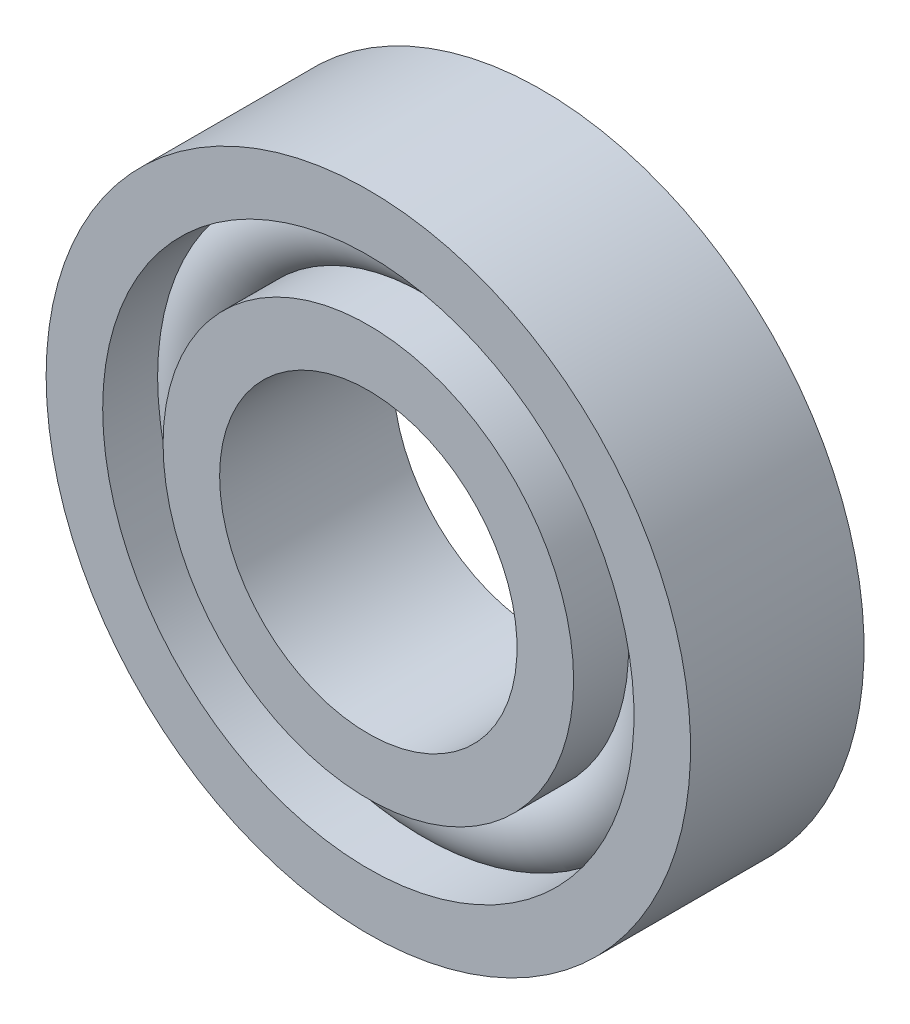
ISO-10303-21;
HEADER;
FILE_DESCRIPTION(('STEP AP214'),'2;1');
FILE_NAME('part.step','',(''),(''),'','','');
FILE_SCHEMA(('AUTOMOTIVE_DESIGN { 1 0 10303 214 1 1 1 1 }'));
ENDSEC;
DATA;
#1=APPLICATION_CONTEXT('core data for automotive mechanical design processes');
#2=APPLICATION_PROTOCOL_DEFINITION('international standard','automotive_design',2000,#1);
#3=PRODUCT_CONTEXT('',#1,'mechanical');
#4=PRODUCT('Part','Part','',(#3));
#5=PRODUCT_RELATED_PRODUCT_CATEGORY('part','',(#4));
#6=PRODUCT_DEFINITION_FORMATION('','',#4);
#7=PRODUCT_DEFINITION_CONTEXT('part definition',#1,'design');
#8=PRODUCT_DEFINITION('design','',#6,#7);
#9=PRODUCT_DEFINITION_SHAPE('','',#8);
#10=(LENGTH_UNIT() NAMED_UNIT(*) SI_UNIT(.MILLI.,.METRE.));
#11=(NAMED_UNIT(*) PLANE_ANGLE_UNIT() SI_UNIT($,.RADIAN.));
#12=(NAMED_UNIT(*) SI_UNIT($,.STERADIAN.) SOLID_ANGLE_UNIT());
#13=UNCERTAINTY_MEASURE_WITH_UNIT(LENGTH_MEASURE(1.E-05),#10,'distance_accuracy_value','');
#14=(GEOMETRIC_REPRESENTATION_CONTEXT(3) GLOBAL_UNCERTAINTY_ASSIGNED_CONTEXT((#13)) GLOBAL_UNIT_ASSIGNED_CONTEXT((#10,
#11,#12)) REPRESENTATION_CONTEXT('',''));
#15=CARTESIAN_POINT('',(0.,0.,0.));
#16=DIRECTION('',(0.,0.,1.));
#17=DIRECTION('',(1.,0.,0.));
#18=AXIS2_PLACEMENT_3D('',#15,#16,#17);
#19=CARTESIAN_POINT('',(0.,0.,1.925));
#20=DIRECTION('',(0.,0.,-1.));
#21=DIRECTION('',(-1.,0.,0.));
#22=AXIS2_PLACEMENT_3D('',#19,#20,#21);
#23=CYLINDRICAL_SURFACE('',#22,3.);
#24=CARTESIAN_POINT('',(0.,0.,1.75));
#25=DIRECTION('',(0.,0.,-1.));
#26=DIRECTION('',(-1.,0.,0.));
#27=AXIS2_PLACEMENT_3D('',#24,#25,#26);
#28=CIRCLE('',#27,3.);
#29=CARTESIAN_POINT('',(-3.,0.,1.75));
#30=VERTEX_POINT('',#29);
#31=EDGE_CURVE('E18',#30,#30,#28,.F.);
#32=ORIENTED_EDGE('',*,*,#31,.T.);
#33=EDGE_LOOP('',(#32));
#34=FACE_BOUND('',#33,.T.);
#35=CARTESIAN_POINT('',(0.,0.,-1.75));
#36=DIRECTION('',(0.,0.,-1.));
#37=DIRECTION('',(-1.,0.,0.));
#38=AXIS2_PLACEMENT_3D('',#35,#36,#37);
#39=CIRCLE('',#38,3.);
#40=CARTESIAN_POINT('',(-3.,0.,-1.75));
#41=VERTEX_POINT('',#40);
#42=EDGE_CURVE('E44',#41,#41,#39,.F.);
#43=ORIENTED_EDGE('',*,*,#42,.F.);
#44=EDGE_LOOP('',(#43));
#45=FACE_BOUND('',#44,.T.);
#46=ADVANCED_FACE('F15',(#34,#45),#23,.F.);
#47=CARTESIAN_POINT('',(0.,0.,1.75));
#48=DIRECTION('',(0.,0.,-1.));
#49=DIRECTION('',(-1.,0.,0.));
#50=AXIS2_PLACEMENT_3D('',#47,#48,#49);
#51=PLANE('',#50);
#52=CARTESIAN_POINT('',(0.,0.,1.75));
#53=DIRECTION('',(0.,0.,-1.));
#54=DIRECTION('',(-1.,0.,0.));
#55=AXIS2_PLACEMENT_3D('',#52,#53,#54);
#56=CIRCLE('',#55,4.141);
#57=CARTESIAN_POINT('',(-4.141,0.,1.75));
#58=VERTEX_POINT('',#57);
#59=EDGE_CURVE('E42',#58,#58,#56,.T.);
#60=ORIENTED_EDGE('',*,*,#59,.F.);
#61=EDGE_LOOP('',(#60));
#62=FACE_BOUND('',#61,.T.);
#63=ORIENTED_EDGE('',*,*,#31,.F.);
#64=EDGE_LOOP('',(#63));
#65=FACE_BOUND('',#64,.T.);
#66=ADVANCED_FACE('F53',(#62,#65),#51,.F.);
#67=CARTESIAN_POINT('',(0.,0.,-1.75));
#68=DIRECTION('',(0.,0.,-1.));
#69=DIRECTION('',(-1.,0.,0.));
#70=AXIS2_PLACEMENT_3D('',#67,#68,#69);
#71=PLANE('',#70);
#72=CARTESIAN_POINT('',(0.,0.,-1.75));
#73=DIRECTION('',(0.,0.,-1.));
#74=DIRECTION('',(-1.,0.,0.));
#75=AXIS2_PLACEMENT_3D('',#72,#73,#74);
#76=CIRCLE('',#75,4.141);
#77=CARTESIAN_POINT('',(-4.141,0.,-1.75));
#78=VERTEX_POINT('',#77);
#79=EDGE_CURVE('E39',#78,#78,#76,.F.);
#80=ORIENTED_EDGE('',*,*,#79,.F.);
#81=EDGE_LOOP('',(#80));
#82=FACE_BOUND('',#81,.T.);
#83=ORIENTED_EDGE('',*,*,#42,.T.);
#84=EDGE_LOOP('',(#83));
#85=FACE_BOUND('',#84,.T.);
#86=ADVANCED_FACE('F55',(#82,#85),#71,.T.);
#87=CARTESIAN_POINT('',(0.,0.,1.925));
#88=DIRECTION('',(0.,0.,-1.));
#89=DIRECTION('',(-1.,0.,0.));
#90=AXIS2_PLACEMENT_3D('',#87,#88,#89);
#91=CYLINDRICAL_SURFACE('',#90,4.141);
#92=ORIENTED_EDGE('',*,*,#59,.T.);
#93=EDGE_LOOP('',(#92));
#94=FACE_BOUND('',#93,.T.);
#95=CARTESIAN_POINT('',(0.,0.,0.642140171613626));
#96=DIRECTION('',(0.,0.,-1.));
#97=DIRECTION('',(0.,-1.,0.));
#98=AXIS2_PLACEMENT_3D('',#95,#96,#97);
#99=CIRCLE('',#98,4.14099999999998);
#100=CARTESIAN_POINT('',(0.,-4.14099999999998,0.642140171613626));
#101=VERTEX_POINT('',#100);
#102=EDGE_CURVE('E30',#101,#101,#99,.T.);
#103=ORIENTED_EDGE('',*,*,#102,.F.);
#104=EDGE_LOOP('',(#103));
#105=FACE_BOUND('',#104,.T.);
#106=ADVANCED_FACE('F62',(#94,#105),#91,.T.);
#107=CARTESIAN_POINT('',(0.,0.,1.925));
#108=DIRECTION('',(0.,0.,-1.));
#109=DIRECTION('',(-1.,0.,0.));
#110=AXIS2_PLACEMENT_3D('',#107,#108,#109);
#111=CYLINDRICAL_SURFACE('',#110,4.141);
#112=CARTESIAN_POINT('',(0.,0.,-0.642140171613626));
#113=DIRECTION('',(0.,0.,-1.));
#114=DIRECTION('',(0.,-1.,0.));
#115=AXIS2_PLACEMENT_3D('',#112,#113,#114);
#116=CIRCLE('',#115,4.14099999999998);
#117=CARTESIAN_POINT('',(0.,-4.14099999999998,-0.642140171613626));
#118=VERTEX_POINT('',#117);
#119=EDGE_CURVE('E106',#118,#118,#116,.F.);
#120=ORIENTED_EDGE('',*,*,#119,.F.);
#121=EDGE_LOOP('',(#120));
#122=FACE_BOUND('',#121,.T.);
#123=ORIENTED_EDGE('',*,*,#79,.T.);
#124=EDGE_LOOP('',(#123));
#125=FACE_BOUND('',#124,.T.);
#126=ADVANCED_FACE('F117',(#122,#125),#111,.T.);
#127=CARTESIAN_POINT('',(0.,0.,0.));
#128=DIRECTION('',(0.,0.,-1.));
#129=DIRECTION('',(0.,-1.,0.));
#130=AXIS2_PLACEMENT_3D('',#127,#128,#129);
#131=TOROIDAL_SURFACE('',#130,4.75,0.885);
#132=ORIENTED_EDGE('',*,*,#102,.T.);
#133=EDGE_LOOP('',(#132));
#134=FACE_BOUND('',#133,.T.);
#135=CARTESIAN_POINT('',(0.,0.,0.642140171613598));
#136=DIRECTION('',(0.,0.,-1.));
#137=DIRECTION('',(-1.,0.,0.));
#138=AXIS2_PLACEMENT_3D('',#135,#136,#137);
#139=CIRCLE('',#138,5.359);
#140=CARTESIAN_POINT('',(-5.359,0.,0.642140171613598));
#141=VERTEX_POINT('',#140);
#142=EDGE_CURVE('E104',#141,#141,#139,.F.);
#143=ORIENTED_EDGE('',*,*,#142,.T.);
#144=EDGE_LOOP('',(#143));
#145=FACE_BOUND('',#144,.T.);
#146=ADVANCED_FACE('F97',(#134,#145),#131,.T.);
#147=CARTESIAN_POINT('',(0.,0.,0.));
#148=DIRECTION('',(0.,0.,-1.));
#149=DIRECTION('',(0.,-1.,0.));
#150=AXIS2_PLACEMENT_3D('',#147,#148,#149);
#151=TOROIDAL_SURFACE('',#150,4.75,0.885);
#152=CARTESIAN_POINT('',(0.,0.,-0.642140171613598));
#153=DIRECTION('',(0.,0.,-1.));
#154=DIRECTION('',(-1.,0.,0.));
#155=AXIS2_PLACEMENT_3D('',#152,#153,#154);
#156=CIRCLE('',#155,5.359);
#157=CARTESIAN_POINT('',(-5.359,0.,-0.642140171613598));
#158=VERTEX_POINT('',#157);
#159=EDGE_CURVE('E38',#158,#158,#156,.T.);
#160=ORIENTED_EDGE('',*,*,#159,.T.);
#161=EDGE_LOOP('',(#160));
#162=FACE_BOUND('',#161,.T.);
#163=ORIENTED_EDGE('',*,*,#119,.T.);
#164=EDGE_LOOP('',(#163));
#165=FACE_BOUND('',#164,.T.);
#166=ADVANCED_FACE('F92',(#162,#165),#151,.T.);
#167=CARTESIAN_POINT('',(0.,0.,1.925));
#168=DIRECTION('',(0.,0.,-1.));
#169=DIRECTION('',(-1.,0.,0.));
#170=AXIS2_PLACEMENT_3D('',#167,#168,#169);
#171=CYLINDRICAL_SURFACE('',#170,5.359);
#172=ORIENTED_EDGE('',*,*,#142,.F.);
#173=EDGE_LOOP('',(#172));
#174=FACE_BOUND('',#173,.T.);
#175=CARTESIAN_POINT('',(0.,0.,1.75));
#176=DIRECTION('',(0.,0.,-1.));
#177=DIRECTION('',(-1.,0.,0.));
#178=AXIS2_PLACEMENT_3D('',#175,#176,#177);
#179=CIRCLE('',#178,5.359);
#180=CARTESIAN_POINT('',(-5.359,0.,1.75));
#181=VERTEX_POINT('',#180);
#182=EDGE_CURVE('E35',#181,#181,#179,.F.);
#183=ORIENTED_EDGE('',*,*,#182,.T.);
#184=EDGE_LOOP('',(#183));
#185=FACE_BOUND('',#184,.T.);
#186=ADVANCED_FACE('F88',(#174,#185),#171,.F.);
#187=CARTESIAN_POINT('',(0.,0.,1.925));
#188=DIRECTION('',(0.,0.,-1.));
#189=DIRECTION('',(-1.,0.,0.));
#190=AXIS2_PLACEMENT_3D('',#187,#188,#189);
#191=CYLINDRICAL_SURFACE('',#190,5.359);
#192=ORIENTED_EDGE('',*,*,#159,.F.);
#193=EDGE_LOOP('',(#192));
#194=FACE_BOUND('',#193,.T.);
#195=CARTESIAN_POINT('',(0.,0.,-1.75));
#196=DIRECTION('',(0.,0.,-1.));
#197=DIRECTION('',(-1.,0.,0.));
#198=AXIS2_PLACEMENT_3D('',#195,#196,#197);
#199=CIRCLE('',#198,5.359);
#200=CARTESIAN_POINT('',(-5.359,0.,-1.75));
#201=VERTEX_POINT('',#200);
#202=EDGE_CURVE('E27',#201,#201,#199,.F.);
#203=ORIENTED_EDGE('',*,*,#202,.F.);
#204=EDGE_LOOP('',(#203));
#205=FACE_BOUND('',#204,.T.);
#206=ADVANCED_FACE('F84',(#194,#205),#191,.F.);
#207=CARTESIAN_POINT('',(0.,0.,1.75));
#208=DIRECTION('',(0.,0.,-1.));
#209=DIRECTION('',(-1.,0.,0.));
#210=AXIS2_PLACEMENT_3D('',#207,#208,#209);
#211=PLANE('',#210);
#212=CARTESIAN_POINT('',(0.,0.,1.75));
#213=DIRECTION('',(0.,0.,-1.));
#214=DIRECTION('',(-1.,0.,0.));
#215=AXIS2_PLACEMENT_3D('',#212,#213,#214);
#216=CIRCLE('',#215,6.5);
#217=CARTESIAN_POINT('',(-6.5,0.,1.75));
#218=VERTEX_POINT('',#217);
#219=EDGE_CURVE('E22',#218,#218,#216,.T.);
#220=ORIENTED_EDGE('',*,*,#219,.F.);
#221=EDGE_LOOP('',(#220));
#222=FACE_BOUND('',#221,.T.);
#223=ORIENTED_EDGE('',*,*,#182,.F.);
#224=EDGE_LOOP('',(#223));
#225=FACE_BOUND('',#224,.T.);
#226=ADVANCED_FACE('F74',(#222,#225),#211,.F.);
#227=CARTESIAN_POINT('',(0.,0.,-1.75));
#228=DIRECTION('',(0.,0.,-1.));
#229=DIRECTION('',(-1.,0.,0.));
#230=AXIS2_PLACEMENT_3D('',#227,#228,#229);
#231=PLANE('',#230);
#232=CARTESIAN_POINT('',(0.,0.,-1.75));
#233=DIRECTION('',(0.,0.,-1.));
#234=DIRECTION('',(-1.,0.,0.));
#235=AXIS2_PLACEMENT_3D('',#232,#233,#234);
#236=CIRCLE('',#235,6.5);
#237=CARTESIAN_POINT('',(-6.5,0.,-1.75));
#238=VERTEX_POINT('',#237);
#239=EDGE_CURVE('E10',#238,#238,#236,.F.);
#240=ORIENTED_EDGE('',*,*,#239,.F.);
#241=EDGE_LOOP('',(#240));
#242=FACE_BOUND('',#241,.T.);
#243=ORIENTED_EDGE('',*,*,#202,.T.);
#244=EDGE_LOOP('',(#243));
#245=FACE_BOUND('',#244,.T.);
#246=ADVANCED_FACE('F68',(#242,#245),#231,.T.);
#247=CARTESIAN_POINT('',(0.,0.,1.925));
#248=DIRECTION('',(0.,0.,-1.));
#249=DIRECTION('',(-1.,0.,0.));
#250=AXIS2_PLACEMENT_3D('',#247,#248,#249);
#251=CYLINDRICAL_SURFACE('',#250,6.5);
#252=ORIENTED_EDGE('',*,*,#239,.T.);
#253=EDGE_LOOP('',(#252));
#254=FACE_BOUND('',#253,.T.);
#255=ORIENTED_EDGE('',*,*,#219,.T.);
#256=EDGE_LOOP('',(#255));
#257=FACE_BOUND('',#256,.T.);
#258=ADVANCED_FACE('F66',(#254,#257),#251,.T.);
#259=CLOSED_SHELL('',(#46,#66,#86,#106,#126,#146,#166,#186,#206,#226,#246,#258));
#260=CARTESIAN_POINT('',(0.,0.,0.));
#261=DIRECTION('',(0.,0.,-1.));
#262=DIRECTION('',(0.,-1.,0.));
#263=AXIS2_PLACEMENT_3D('',#260,#261,#262);
#264=TOROIDAL_SURFACE('',#263,4.75,0.875);
#265=ADVANCED_FACE('F79',(),#264,.F.);
#266=CLOSED_SHELL('',(#265));
#267=ORIENTED_CLOSED_SHELL('',*,#266,.T.);
#268=BREP_WITH_VOIDS('B1',#259,(#267));
#269=ADVANCED_BREP_SHAPE_REPRESENTATION('',(#18,#268),#14);
#270=SHAPE_DEFINITION_REPRESENTATION(#9,#269);
ENDSEC;
END-ISO-10303-21;
